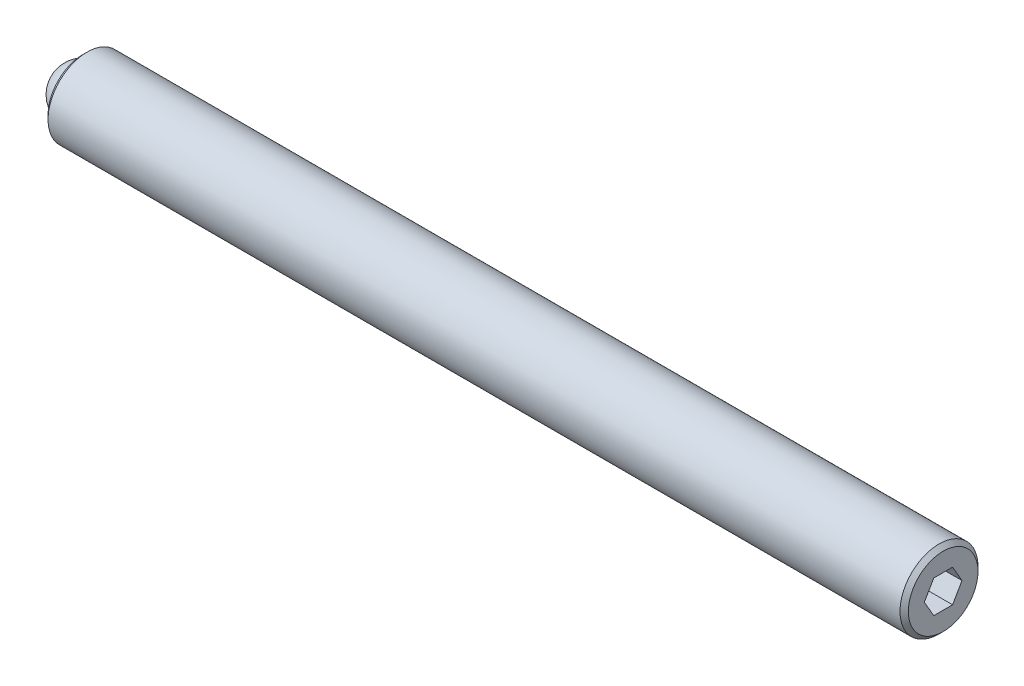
from build123d import *

# Parameters (mm, degrees)
SKETCH2_R           = 2.3749
BOSS_EXTRUDE1_DEPTH = 52.3875
CHAMFER1_SIZE       = 0.254
CHAMFER2_SIZE       = 0.254
CUT_EXTRUDE2_DEPTH  = 2.286
SKETCH3_R           = 1.5875
CUT_EXTRUDE3_DEPTH  = 1.5875


with BuildPart() as part:
    # Sketch2 → Boss-Extrude1 (new body)
    with BuildSketch(Plane(origin=(0, 0, 0), x_dir=(0, 0, -1), z_dir=(1, 0, 0))):
        Circle(SKETCH2_R)
    extrude(amount=BOSS_EXTRUDE1_DEPTH)

    # Chamfer1
    chamfer1_edges = [part.edges().sort_by_distance(p)[0] for p in [
        (0, 0, 2.3749),
    ]]
    chamfer(chamfer1_edges, length=CHAMFER1_SIZE)

    # Chamfer2
    chamfer2_edges = [part.edges().sort_by_distance(p)[0] for p in [
        (52.3875, 0, 2.3749),
    ]]
    chamfer(chamfer2_edges, length=CHAMFER2_SIZE)

    # Sketch4 → Cut-Extrude2 (cut)
    with BuildSketch(Plane(origin=(52.3875, 0, 0), x_dir=(0, 0, -1), z_dir=(1, 0, 0))):
        Polygon((1.14567944, 0), (0.57283972, 0.9921875), (-0.57283972, 0.9921875), (-1.14567944, 0), (-0.57283972, -0.9921875), (0.57283972, -0.9921875), align=None)
    extrude(amount=-CUT_EXTRUDE2_DEPTH, mode=Mode.SUBTRACT)

    # Sketch3 → Cut-Extrude3 (cut)
    with BuildSketch(Plane.ZY):
        Circle(SKETCH3_R)
    extrude(amount=-CUT_EXTRUDE3_DEPTH, mode=Mode.SUBTRACT)


with BuildPart() as body_2:
    # Sketch5 → Revolve1 (revolve)
    with BuildSketch(Plane.ZY):
        with BuildLine():
            Line((0, 0), (0, -1.5875))
            ThreePointArc((0, -1.5875), (-1.5875, 0), (0, 1.5875))
            Line((0, 1.5875), (0, 0))
        make_face()
    revolve(axis=Axis((0, 0, 0), (0, 1, 0)))


solid = Compound([part.part, body_2.part])
